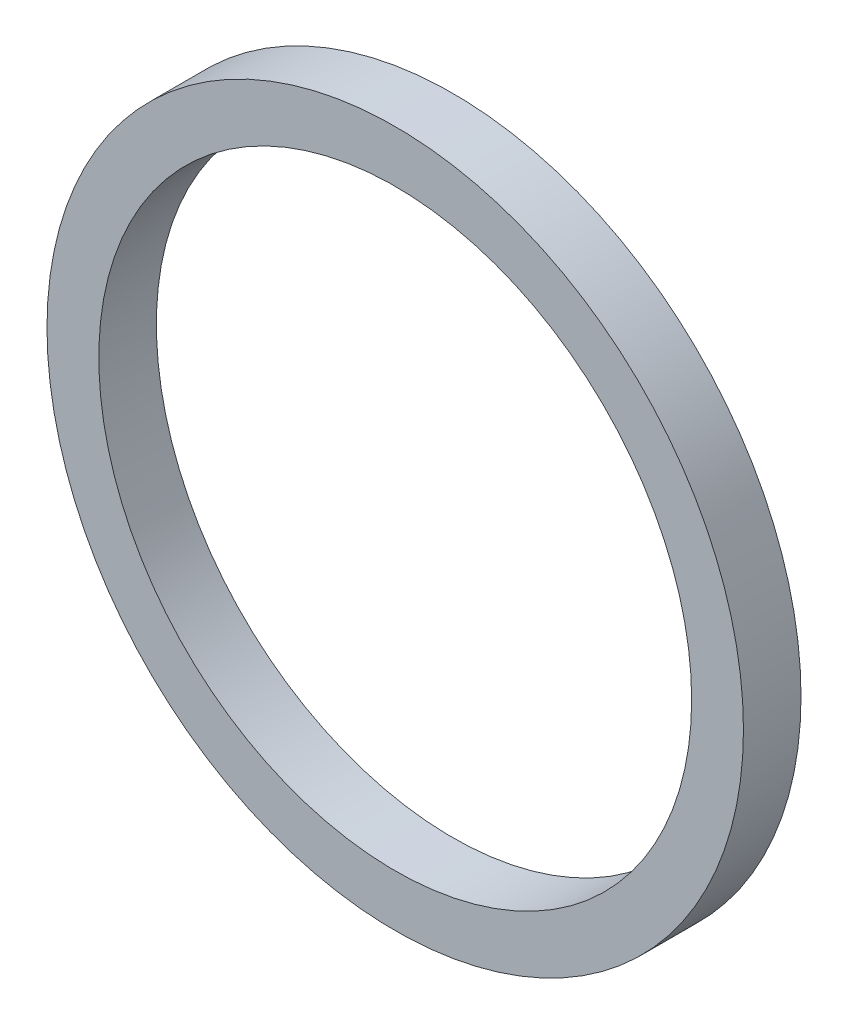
from build123d import *

# Parameters (mm, degrees)
SKETCH_1_R      = 6.05
SKETCH_1_R_2    = 5.15
EXTRUDE_1_DEPTH = 1


with BuildPart() as part:
    # Sketch 1 → Extrude 1 (new body)
    with BuildSketch(Plane.XY):
        with Locations((-30.625238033, 42.404175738)):
            Circle(SKETCH_1_R)
        with Locations((-30.625238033, 42.404175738)):
            Circle(SKETCH_1_R_2, mode=Mode.SUBTRACT)
    extrude(amount=EXTRUDE_1_DEPTH)


solid = part.part
